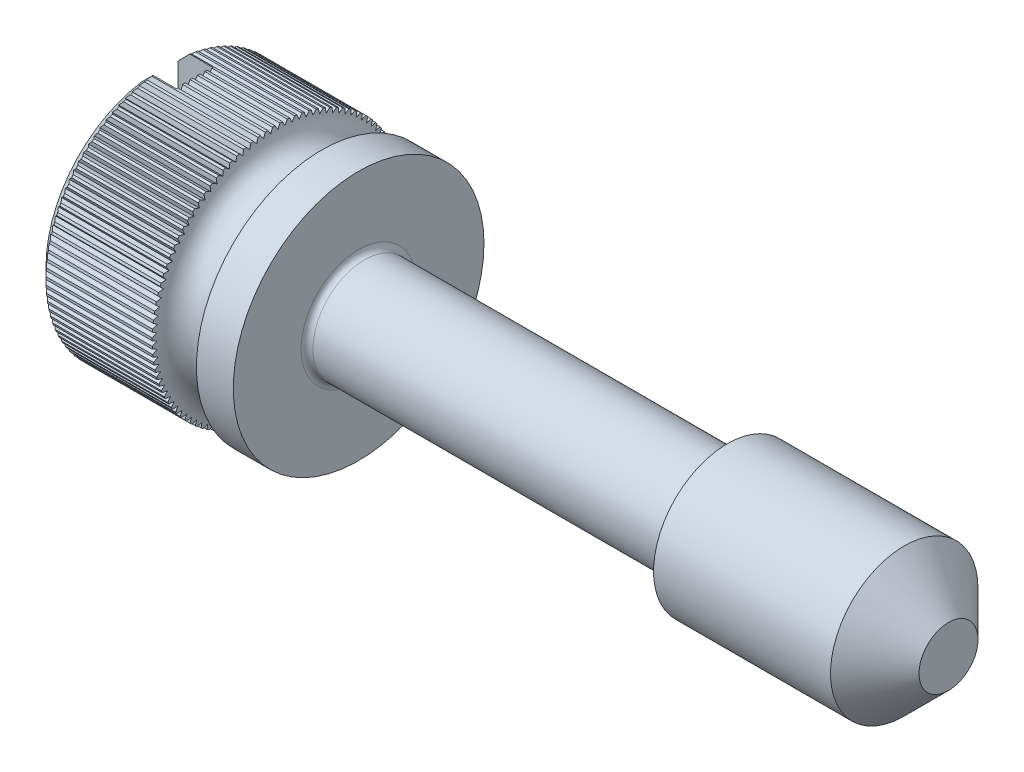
from build123d import *

# Parameters (mm, degrees)
SKETCH1_R                     = 8.5
BASEHEAD_DEPTH                = 13.5
CHAMFER1_SIZE                 = 0.8
CUT_EXTRUDE1_REACH            = 20.076
CUT_EXTRUDE1_END_MAJOR_RADIUS = 8.5
CUT_EXTRUDE1_END_MINOR_RADIUS = 1.5
CIRCULARPATTERN1_COUNT        = 107
SKETCH4_R                     = 3.5
BASEBODY_DEPTH                = 40
SKETCH5_R                     = 5
BASEEND_DEPTH                 = 15
CHAMFER2_SIZE                 = 3
FILLET1_R                     = 0.4
CUT_EXTRUDE2_DEPTH            = 67.884487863
CUT_EXTRUDE2_DEPTH_BACK       = 67.884487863
SKETCH6_W                     = 2.5
SKETCH6_H                     = 7.4


with BuildPart() as part:
    # Sketch1 → BaseHead (new body)
    with BuildSketch(Plane(origin=(0, 0, 0), x_dir=(0, 0, -1), z_dir=(1, 0, 0))):
        Circle(SKETCH1_R)
    extrude(amount=BASEHEAD_DEPTH)

    # Sketch2 → Cut-Revolve1 (revolve, cut)
    with BuildSketch(Plane(origin=(12.663511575, 0, 1.163511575), x_dir=(0, 0, 1), z_dir=(0, 1, 0)), mode=Mode.PRIVATE) as cut_revolve1_sk:
        with BuildLine():
            Line((7.336488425, -1.663511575), (10.336488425, -1.663511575))
            Line((10.336488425, -1.663511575), (10.336488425, -4.663511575))
            Line((10.336488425, -4.663511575), (7.336488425, -4.663511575))
            ThreePointArc((7.336488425, -4.663511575), (5.836488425, -3.163511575), (7.336488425, -1.663511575))
        make_face()
    revolve(cut_revolve1_sk.sketch.rotate(Axis((17.65542619, 0, 0), (-1, 0, 0)), 180), axis=Axis((17.65542619, 0, 0), (-1, 0, 0)), mode=Mode.SUBTRACT)

    # Chamfer1
    chamfer1_edges = [part.edges().sort_by_distance(p)[0] for p in [
        (0, 0, 8.5),
    ]]
    chamfer(chamfer1_edges, length=CHAMFER1_SIZE)

    # Cut-Extrude1: up to this torus (the profile starts outside it)
    cut_extrude1_end = Plane(origin=(9.5, 0, 0), z_dir=(1, 0, 0)) * Torus(CUT_EXTRUDE1_END_MAJOR_RADIUS, CUT_EXTRUDE1_END_MINOR_RADIUS, mode=Mode.PRIVATE)
    # Sketch3 → Cut-Extrude1 (cut, up to the surface)
    with BuildSketch(Plane(origin=(0, 0, 0), x_dir=(0, 0, -1), z_dir=(1, 0, 0)), mode=Mode.PRIVATE) as cut_extrude1_sk1:
        Polygon((0, 8.211324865), (0.25, 8.644337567), (-0.25, 8.644337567), align=None)
    cut_extrude1_tool1 = extrude(cut_extrude1_sk1.sketch, amount=CUT_EXTRUDE1_REACH, mode=Mode.PRIVATE) - cut_extrude1_end
    cut_extrude1 = cut_extrude1_tool1.solids().sort_by_distance((0, 8.5, 0))[0]
    add(cut_extrude1, mode=Mode.SUBTRACT)

    # CircularPattern1: Cut-Extrude1 ×107 about axis
    circularpattern1_axis = Axis((0, 0, 0), (1, 0, 0))
    for i in range(1, CIRCULARPATTERN1_COUNT):
        add(cut_extrude1.rotate(circularpattern1_axis, i * 360 / CIRCULARPATTERN1_COUNT), mode=Mode.SUBTRACT)

    # Sketch4 → BaseBody (add)
    with BuildSketch(Plane(origin=(13.5, 4.485233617, -2.150386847), x_dir=(0, 0, -1), z_dir=(1, 0, 0))):
        with Locations((-2.150386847, -4.485233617)):
            Circle(SKETCH4_R)
    extrude(amount=BASEBODY_DEPTH)

    # Sketch5 → BaseEnd (add)
    with BuildSketch(Plane(origin=(53.5, -0.857503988, -1.490033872), x_dir=(0, 0, -1), z_dir=(1, 0, 0))):
        with Locations((-1.490033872, 0.857503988)):
            Circle(SKETCH5_R)
    extrude(amount=-BASEEND_DEPTH)

    # Chamfer2
    chamfer2_edges = [part.edges().sort_by_distance(p)[0] for p in [
        (53.5, 0, 5),
    ]]
    chamfer(chamfer2_edges, length=CHAMFER2_SIZE)

    # Fillet1
    fillet1_edges = [part.edges().sort_by_distance(p)[0] for p in [
        (13.5, 0, 3.5),
        (38.5, 0, 3.5),
    ]]
    fillet(fillet1_edges, radius=FILLET1_R)

    # Sketch6 → Cut-Extrude2 (cut, two sides: drawn at the far end of the back side and taken through both)
    with BuildSketch(Plane(origin=(-10.162997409, 0, -10.162997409), x_dir=(0, 0, 1), z_dir=(0, 1, 0)).offset(-CUT_EXTRUDE2_DEPTH_BACK)):
        with Locations((10.162997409, 8.862997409)):
            Rectangle(SKETCH6_W, SKETCH6_H)
    extrude(amount=CUT_EXTRUDE2_DEPTH + CUT_EXTRUDE2_DEPTH_BACK, mode=Mode.SUBTRACT)


solid = part.part
